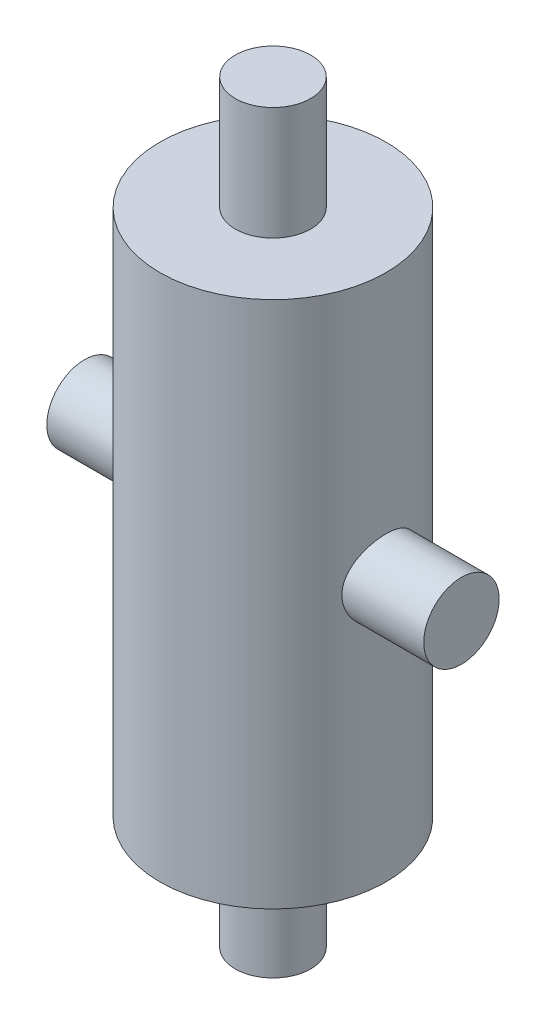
from build123d import *

# Parameters (mm, degrees)
BOSS_EXTRUDE1_DEPTH      = 25
BOSS_EXTRUDE1_DEPTH_BACK = 25
SKETCH2_R                = 5


with BuildPart() as part:
    # Sketch1 → Revolve1 (revolve)
    with BuildSketch(Plane.XY, mode=Mode.PRIVATE) as revolve1_sk:
        Polygon((0, 0), (5, 0), (5, -15), (15, -15), (15, -85), (5, -85), (5, -100), (0, -100), align=None)
    revolve(revolve1_sk.sketch.rotate(Axis((0, 27.746394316, 0), (0, -1, 0)), 90), axis=Axis((0, 27.746394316, 0), (0, -1, 0)))

    # Sketch2 → Boss-Extrude1 (add, two sides: drawn at the far end of the back side and taken through both)
    with BuildSketch(Plane(origin=(0, 0, 0), x_dir=(0, 0, -1), z_dir=(1, 0, 0)).offset(-BOSS_EXTRUDE1_DEPTH_BACK)):
        with Locations((0, -50)):
            Circle(SKETCH2_R)
    extrude(amount=BOSS_EXTRUDE1_DEPTH + BOSS_EXTRUDE1_DEPTH_BACK)


solid = part.part
